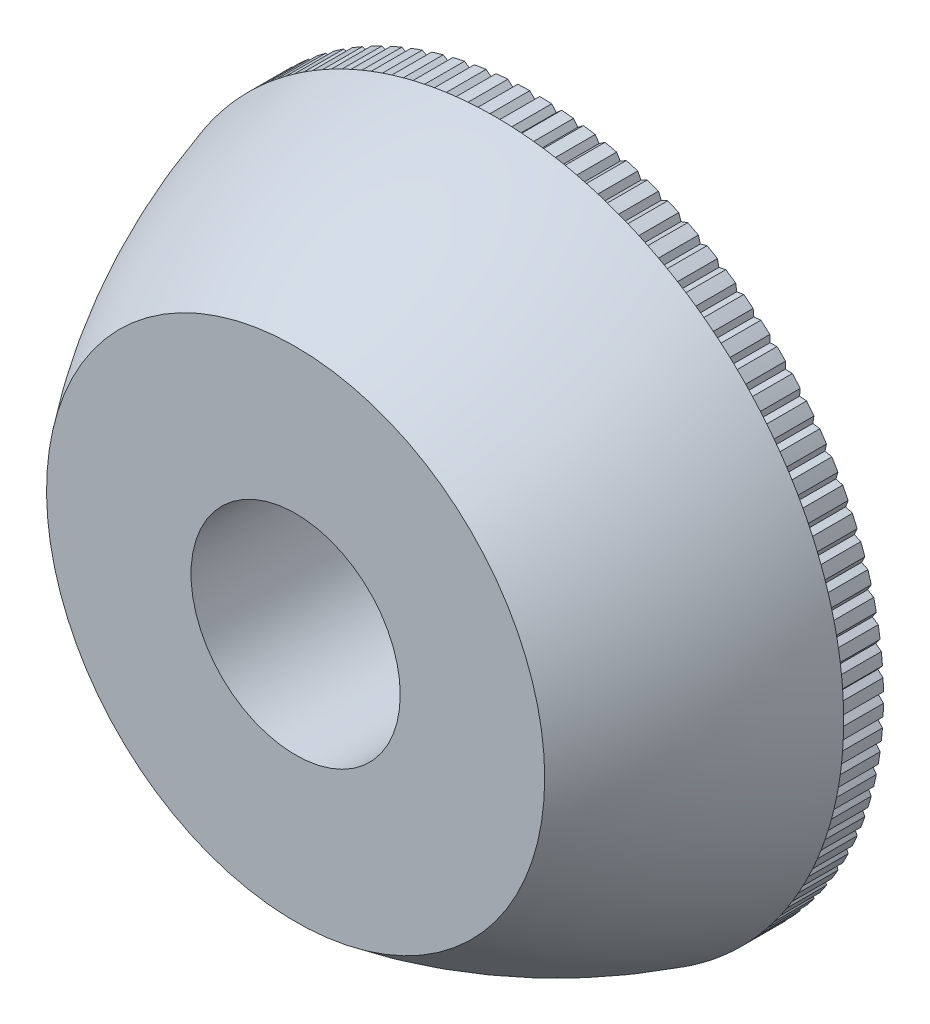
from build123d import *

# Parameters (mm, degrees)
M12X1_5_TAPPED_HOLE1_D = 10.5
CUT_EXTRUDE1_DEPTH     = 2
CIRPATTERN1_COUNT      = 100


with BuildPart() as part:
    # Sketch1 → Revolve1 (revolve)
    with BuildSketch(Plane(origin=(0, 0, 0), x_dir=(1, 0, 0), z_dir=(0, 1, 0))):
        with BuildLine():
            Line((0, 0), (12.5, 0))
            ThreePointArc((12.5, 0), (15.469963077, 4.765018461), (17.5, 10))
            Line((17.5, 10), (17.5, 12))
            Line((17.5, 12), (0, 12))
            Line((0, 12), (0, 0))
        make_face()
    revolve(axis=Axis((0, 0, 0), (0, 0, -1)))

    # M12x1.5 Tapped Hole1 (through all)
    with Locations(Plane.XY):
        with Locations((0, 0)):
            Hole(M12X1_5_TAPPED_HOLE1_D / 2)

    # Sketch4 → Cut-Extrude1 (cut)
    with BuildSketch(Plane(origin=(0, 0, -12), x_dir=(-1, 0, 0), z_dir=(0, 0, -1))):
        with BuildLine():
            Line((0, 17.248214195), (-0.25, 17.498214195))
            ThreePointArc((-0.25, 17.498214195), (0, 17.5), (0.25, 17.498214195))
            Line((0.25, 17.498214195), (0, 17.248214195))
        make_face()
    cut_extrude1 = extrude(amount=-CUT_EXTRUDE1_DEPTH, mode=Mode.SUBTRACT)

    # CirPattern1: Cut-Extrude1 ×100 about axis
    cirpattern1_axis = Axis((0, 0, 0), (0, 0, 1))
    for i in range(1, CIRPATTERN1_COUNT):
        add(cut_extrude1.rotate(cirpattern1_axis, i * 360 / CIRPATTERN1_COUNT), mode=Mode.SUBTRACT)


solid = part.part
